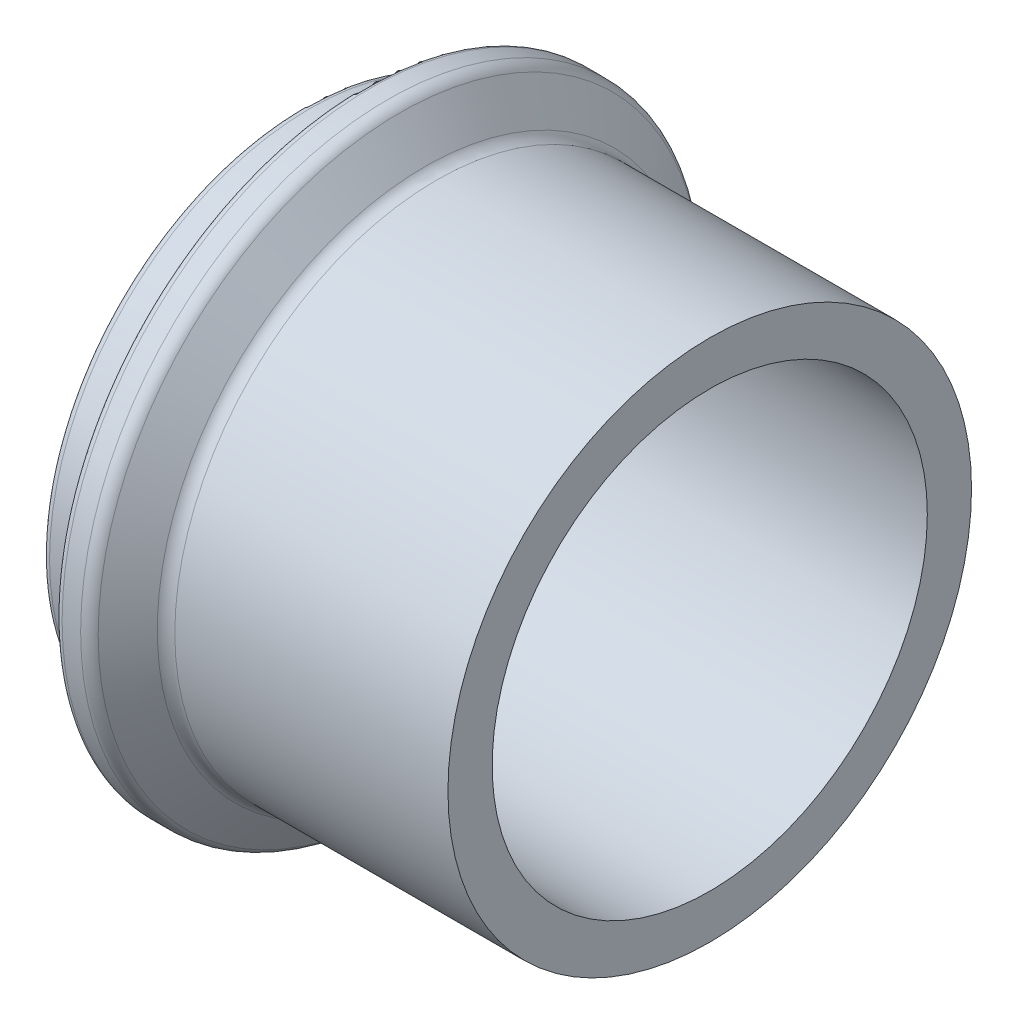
from build123d import *


with BuildPart() as part:
    # Sketch1 → Revolve1 (revolve)
    with BuildSketch(Plane.XY, mode=Mode.PRIVATE) as revolve1_sk:
        with BuildLine():
            Line((0, 23.749), (-44.45, 23.749))
            Line((-44.45, 23.749), (-44.45, 27.6098))
            ThreePointArc((-44.45, 27.6098), (-44.211936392, 28.184536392), (-43.6372, 28.4226))
            Line((-43.6372, 28.4226), (-38.7858, 28.4226))
            ThreePointArc((-38.7858, 28.4226), (-38.211063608, 28.660663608), (-37.973, 29.2354))
            Line((-37.973, 29.2354), (-37.973, 32.7152))
            ThreePointArc((-37.973, 32.7152), (-37.734936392, 33.289936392), (-37.1602, 33.528))
            Line((-37.1602, 33.528), (-35.138630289, 33.528))
            ThreePointArc((-35.138630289, 33.528), (-34.424624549, 33.359873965), (-33.860653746, 32.8908244))
            Line((-33.860653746, 32.8908244), (-31.088593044, 29.2121756))
            ThreePointArc((-31.088593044, 29.2121756), (-30.524622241, 28.743126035), (-29.810616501, 28.575))
            Line((-29.810616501, 28.575), (0, 28.575))
            Line((0, 28.575), (0, 23.749))
        make_face()
    revolve(revolve1_sk.sketch.rotate(Axis((0, 0, 0), (-1, 0, 0)), 90), axis=Axis((0, 0, 0), (-1, 0, 0)))


solid = part.part
